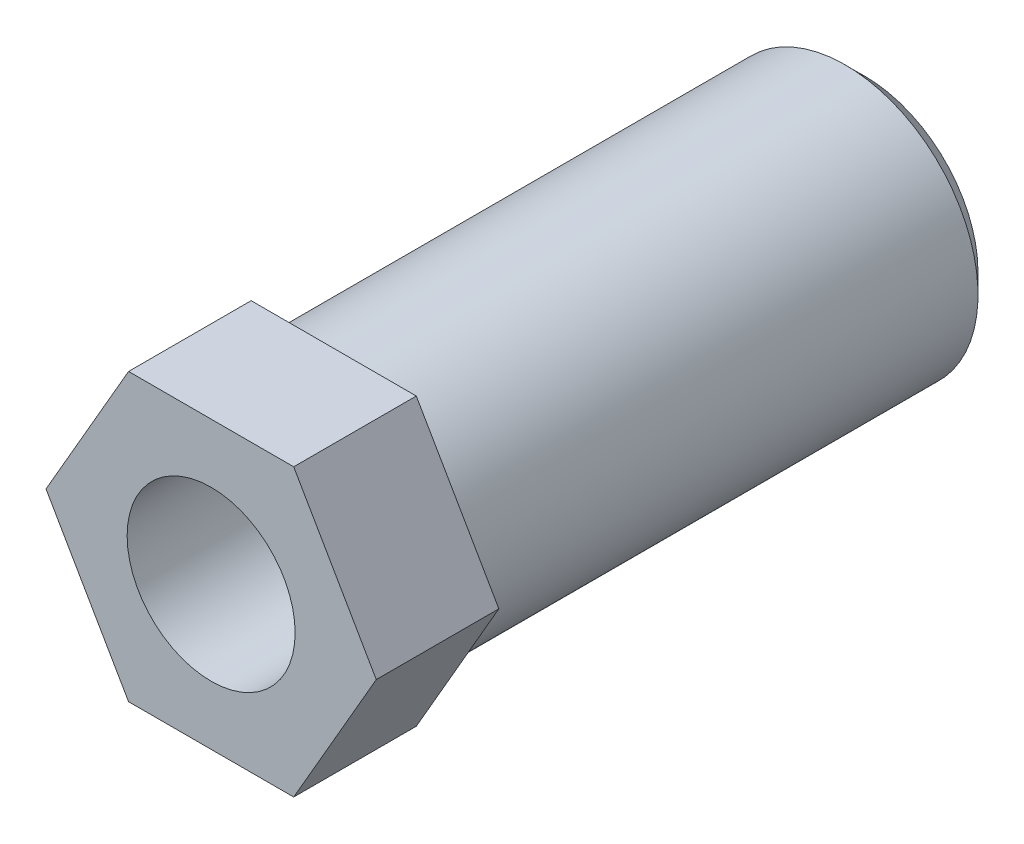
from build123d import *

# Parameters (mm, degrees)
BASE_EXTRUDE_DEPTH       = 25.4
F_5_16_18_TAPPED_HOLE1_D = 6.5278
CHAMFER2_SIZE            = 0.762
SKETCH4_R                = 7.531348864
SKETCH4_R_2              = 5.1562
CUT_EXTRUDE1_DEPTH       = 20.6375
CHAMFER1_SIZE            = 0.762


with BuildPart() as part:
    # Sketch1 → Base-Extrude (new body)
    with BuildSketch(Plane.XY):
        Polygon((6.415804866, 0), (3.207902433, 5.55625), (-3.207902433, 5.55625), (-6.415804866, 0), (-3.207902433, -5.55625), (3.207902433, -5.55625), align=None)
    extrude(amount=BASE_EXTRUDE_DEPTH)

    # 5_16-18 Tapped Hole1 (through all)
    with Locations(Plane(origin=(0, 0, 0), x_dir=(-1, 0, 0), z_dir=(0, 0, -1))):
        with Locations((0, 0)):
            Hole(F_5_16_18_TAPPED_HOLE1_D / 2)

    # Chamfer2
    chamfer2_edges = [part.edges().sort_by_distance(p)[0] for p in [
        (-3.2639, 0, 0),
    ]]
    chamfer(chamfer2_edges, length=CHAMFER2_SIZE)

    # Sketch4 → Cut-Extrude1 (cut)
    with BuildSketch(Plane(origin=(0, 0, 0), x_dir=(-1, 0, 0), z_dir=(0, 0, -1))):
        Circle(SKETCH4_R)
        Circle(SKETCH4_R_2, mode=Mode.SUBTRACT)
    extrude(amount=-CUT_EXTRUDE1_DEPTH, mode=Mode.SUBTRACT)

    # Chamfer1
    chamfer1_edges = [part.edges().sort_by_distance(p)[0] for p in [
        (5.1562, 0, 0),
    ]]
    chamfer(chamfer1_edges, length=CHAMFER1_SIZE)


solid = part.part
